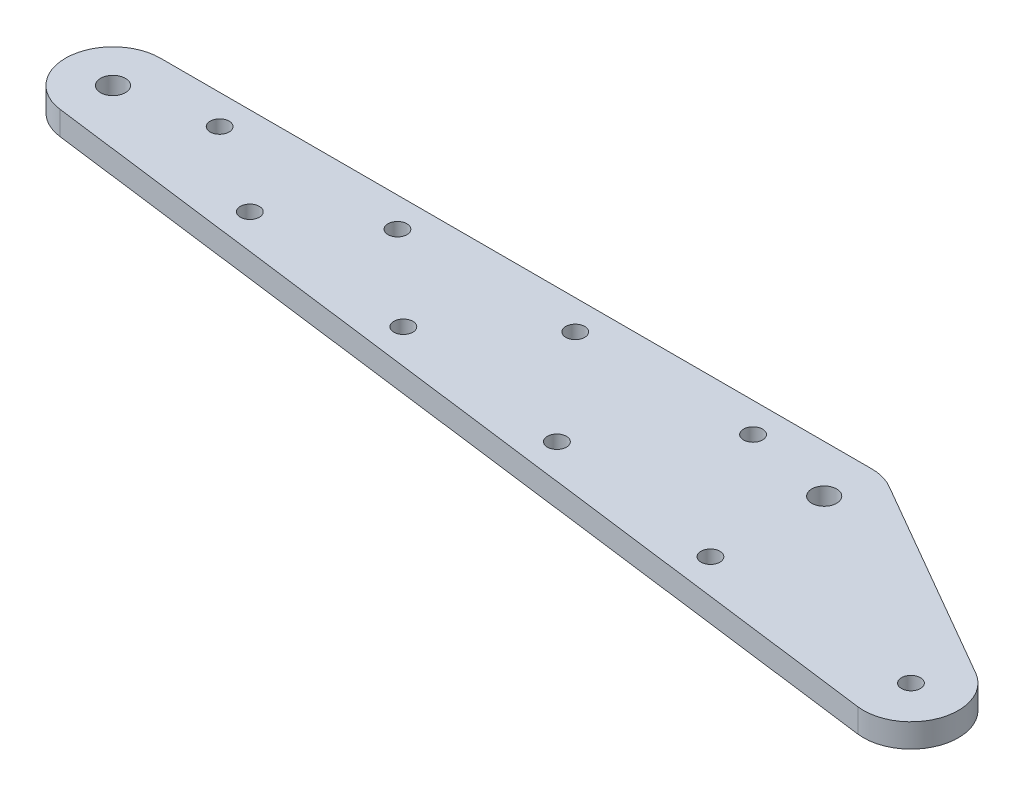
ISO-10303-21;
HEADER;
FILE_DESCRIPTION(('STEP AP214'),'2;1');
FILE_NAME('part.step','',(''),(''),'','','');
FILE_SCHEMA(('AUTOMOTIVE_DESIGN { 1 0 10303 214 1 1 1 1 }'));
ENDSEC;
DATA;
#1=APPLICATION_CONTEXT('core data for automotive mechanical design processes');
#2=APPLICATION_PROTOCOL_DEFINITION('international standard','automotive_design',2000,#1);
#3=PRODUCT_CONTEXT('',#1,'mechanical');
#4=PRODUCT('Part','Part','',(#3));
#5=PRODUCT_RELATED_PRODUCT_CATEGORY('part','',(#4));
#6=PRODUCT_DEFINITION_FORMATION('','',#4);
#7=PRODUCT_DEFINITION_CONTEXT('part definition',#1,'design');
#8=PRODUCT_DEFINITION('design','',#6,#7);
#9=PRODUCT_DEFINITION_SHAPE('','',#8);
#10=(LENGTH_UNIT() NAMED_UNIT(*) SI_UNIT(.MILLI.,.METRE.));
#11=(NAMED_UNIT(*) PLANE_ANGLE_UNIT() SI_UNIT($,.RADIAN.));
#12=(NAMED_UNIT(*) SI_UNIT($,.STERADIAN.) SOLID_ANGLE_UNIT());
#13=UNCERTAINTY_MEASURE_WITH_UNIT(LENGTH_MEASURE(1.E-05),#10,'distance_accuracy_value','');
#14=(GEOMETRIC_REPRESENTATION_CONTEXT(3) GLOBAL_UNCERTAINTY_ASSIGNED_CONTEXT((#13)) GLOBAL_UNIT_ASSIGNED_CONTEXT((#10,
#11,#12)) REPRESENTATION_CONTEXT('',''));
#15=CARTESIAN_POINT('',(0.,0.,0.));
#16=DIRECTION('',(0.,0.,1.));
#17=DIRECTION('',(1.,0.,0.));
#18=AXIS2_PLACEMENT_3D('',#15,#16,#17);
#19=CARTESIAN_POINT('',(0.,4.,0.));
#20=DIRECTION('',(0.,-1.,0.));
#21=DIRECTION('',(0.,0.,-1.));
#22=AXIS2_PLACEMENT_3D('',#19,#20,#21);
#23=PLANE('',#22);
#24=CARTESIAN_POINT('',(15.,4.,-3.));
#25=DIRECTION('',(0.,1.,0.));
#26=DIRECTION('',(0.,0.,1.));
#27=AXIS2_PLACEMENT_3D('',#24,#25,#26);
#28=CIRCLE('',#27,1.6);
#29=CARTESIAN_POINT('',(15.,4.,-1.4));
#30=VERTEX_POINT('',#29);
#31=EDGE_CURVE('E219',#30,#30,#28,.T.);
#32=ORIENTED_EDGE('',*,*,#31,.F.);
#33=EDGE_LOOP('',(#32));
#34=FACE_BOUND('',#33,.T.);
#35=CARTESIAN_POINT('',(30.,4.,6.90493983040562));
#36=DIRECTION('',(0.,1.,0.));
#37=DIRECTION('',(0.,0.,1.));
#38=AXIS2_PLACEMENT_3D('',#35,#36,#37);
#39=CIRCLE('',#38,1.6);
#40=CARTESIAN_POINT('',(30.,4.,8.50493983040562));
#41=VERTEX_POINT('',#40);
#42=EDGE_CURVE('E220',#41,#41,#39,.T.);
#43=ORIENTED_EDGE('',*,*,#42,.F.);
#44=EDGE_LOOP('',(#43));
#45=FACE_BOUND('',#44,.T.);
#46=CARTESIAN_POINT('',(45.,4.,-3.));
#47=DIRECTION('',(0.,1.,0.));
#48=DIRECTION('',(0.,0.,1.));
#49=AXIS2_PLACEMENT_3D('',#46,#47,#48);
#50=CIRCLE('',#49,1.6);
#51=CARTESIAN_POINT('',(45.,4.,-1.40000000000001));
#52=VERTEX_POINT('',#51);
#53=EDGE_CURVE('E230',#52,#52,#50,.T.);
#54=ORIENTED_EDGE('',*,*,#53,.F.);
#55=EDGE_LOOP('',(#54));
#56=FACE_BOUND('',#55,.T.);
#57=CARTESIAN_POINT('',(75.,4.,-3.));
#58=DIRECTION('',(0.,1.,0.));
#59=DIRECTION('',(0.,0.,1.));
#60=AXIS2_PLACEMENT_3D('',#57,#58,#59);
#61=CIRCLE('',#60,1.60000000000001);
#62=CARTESIAN_POINT('',(75.,4.,-1.4));
#63=VERTEX_POINT('',#62);
#64=EDGE_CURVE('E236',#63,#63,#61,.T.);
#65=ORIENTED_EDGE('',*,*,#64,.F.);
#66=EDGE_LOOP('',(#65));
#67=FACE_BOUND('',#66,.T.);
#68=CARTESIAN_POINT('',(105.,4.,-3.));
#69=DIRECTION('',(0.,1.,0.));
#70=DIRECTION('',(0.,0.,1.));
#71=AXIS2_PLACEMENT_3D('',#68,#69,#70);
#72=CIRCLE('',#71,1.60000000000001);
#73=CARTESIAN_POINT('',(105.,4.,-1.4));
#74=VERTEX_POINT('',#73);
#75=EDGE_CURVE('E242',#74,#74,#72,.T.);
#76=ORIENTED_EDGE('',*,*,#75,.F.);
#77=EDGE_LOOP('',(#76));
#78=FACE_BOUND('',#77,.T.);
#79=CARTESIAN_POINT('',(59.7522036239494,4.,10.7528456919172));
#80=DIRECTION('',(0.,1.,0.));
#81=DIRECTION('',(0.,0.,1.));
#82=AXIS2_PLACEMENT_3D('',#79,#80,#81);
#83=CIRCLE('',#82,1.6);
#84=CARTESIAN_POINT('',(59.7522036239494,4.,12.3528456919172));
#85=VERTEX_POINT('',#84);
#86=EDGE_CURVE('E248',#85,#85,#83,.T.);
#87=ORIENTED_EDGE('',*,*,#86,.F.);
#88=EDGE_LOOP('',(#87));
#89=FACE_BOUND('',#88,.T.);
#90=CARTESIAN_POINT('',(89.5044072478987,4.,14.6007515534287));
#91=DIRECTION('',(0.,1.,0.));
#92=DIRECTION('',(0.,0.,1.));
#93=AXIS2_PLACEMENT_3D('',#90,#91,#92);
#94=CIRCLE('',#93,1.6);
#95=CARTESIAN_POINT('',(89.5044072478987,4.,16.2007515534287));
#96=VERTEX_POINT('',#95);
#97=EDGE_CURVE('E254',#96,#96,#94,.T.);
#98=ORIENTED_EDGE('',*,*,#97,.F.);
#99=EDGE_LOOP('',(#98));
#100=FACE_BOUND('',#99,.T.);
#101=CARTESIAN_POINT('',(119.256610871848,4.,18.4486574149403));
#102=DIRECTION('',(0.,1.,0.));
#103=DIRECTION('',(0.,0.,1.));
#104=AXIS2_PLACEMENT_3D('',#101,#102,#103);
#105=CIRCLE('',#104,1.6);
#106=CARTESIAN_POINT('',(119.256610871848,4.,20.0486574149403));
#107=VERTEX_POINT('',#106);
#108=EDGE_CURVE('E260',#107,#107,#105,.T.);
#109=ORIENTED_EDGE('',*,*,#108,.F.);
#110=EDGE_LOOP('',(#109));
#111=FACE_BOUND('',#110,.T.);
#112=CARTESIAN_POINT('',(0.,4.,0.));
#113=DIRECTION('',(0.,1.,0.));
#114=DIRECTION('',(0.,0.,-1.));
#115=AXIS2_PLACEMENT_3D('',#112,#113,#114);
#116=CIRCLE('',#115,8.);
#117=CARTESIAN_POINT('',(0.,4.,-8.));
#118=VERTEX_POINT('',#117);
#119=CARTESIAN_POINT('',(-1.02610822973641,4.,7.93392096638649));
#120=VERTEX_POINT('',#119);
#121=EDGE_CURVE('E137',#118,#120,#116,.T.);
#122=ORIENTED_EDGE('',*,*,#121,.T.);
#123=DIRECTION('',(0.991740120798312,0.,0.128263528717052));
#124=VECTOR('',#123,1.);
#125=CARTESIAN_POINT('',(153.614907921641,4.,27.9339209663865));
#126=LINE('',#125,#124);
#127=CARTESIAN_POINT('',(153.614907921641,4.,27.9339209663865));
#128=VERTEX_POINT('',#127);
#129=EDGE_CURVE('E95',#120,#128,#126,.T.);
#130=ORIENTED_EDGE('',*,*,#129,.T.);
#131=CARTESIAN_POINT('',(154.641016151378,4.,20.));
#132=DIRECTION('',(0.,1.,0.));
#133=DIRECTION('',(0.,0.,-1.));
#134=AXIS2_PLACEMENT_3D('',#131,#132,#133);
#135=CIRCLE('',#134,7.99999999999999);
#136=CARTESIAN_POINT('',(158.641016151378,4.,13.0717967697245));
#137=VERTEX_POINT('',#136);
#138=EDGE_CURVE('E108',#128,#137,#135,.T.);
#139=ORIENTED_EDGE('',*,*,#138,.T.);
#140=DIRECTION('',(-0.866025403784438,0.,-0.500000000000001));
#141=VECTOR('',#140,1.);
#142=CARTESIAN_POINT('',(124.,4.,-6.92820323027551));
#143=LINE('',#142,#141);
#144=CARTESIAN_POINT('',(124.,4.,-6.92820323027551));
#145=VERTEX_POINT('',#144);
#146=EDGE_CURVE('E102',#137,#145,#143,.T.);
#147=ORIENTED_EDGE('',*,*,#146,.T.);
#148=CARTESIAN_POINT('',(120.,4.,0.));
#149=DIRECTION('',(0.,1.,0.));
#150=DIRECTION('',(0.,0.,-1.));
#151=AXIS2_PLACEMENT_3D('',#148,#149,#150);
#152=CIRCLE('',#151,8.);
#153=CARTESIAN_POINT('',(120.,4.,-8.));
#154=VERTEX_POINT('',#153);
#155=EDGE_CURVE('E106',#145,#154,#152,.T.);
#156=ORIENTED_EDGE('',*,*,#155,.T.);
#157=DIRECTION('',(-1.,0.,0.));
#158=VECTOR('',#157,1.);
#159=CARTESIAN_POINT('',(0.,4.,-8.));
#160=LINE('',#159,#158);
#161=EDGE_CURVE('E58',#154,#118,#160,.T.);
#162=ORIENTED_EDGE('',*,*,#161,.T.);
#163=EDGE_LOOP('',(#122,#130,#139,#147,#156,#162));
#164=FACE_BOUND('',#163,.T.);
#165=CARTESIAN_POINT('',(0.,4.,0.));
#166=DIRECTION('',(0.,1.,0.));
#167=DIRECTION('',(0.,0.,1.));
#168=AXIS2_PLACEMENT_3D('',#165,#166,#167);
#169=CIRCLE('',#168,2.1);
#170=CARTESIAN_POINT('',(0.,4.,2.1));
#171=VERTEX_POINT('',#170);
#172=EDGE_CURVE('E130',#171,#171,#169,.T.);
#173=ORIENTED_EDGE('',*,*,#172,.F.);
#174=EDGE_LOOP('',(#173));
#175=FACE_BOUND('',#174,.T.);
#176=CARTESIAN_POINT('',(154.641016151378,4.,20.));
#177=DIRECTION('',(0.,1.,0.));
#178=DIRECTION('',(0.,0.,1.));
#179=AXIS2_PLACEMENT_3D('',#176,#177,#178);
#180=CIRCLE('',#179,1.59999999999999);
#181=CARTESIAN_POINT('',(154.641016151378,4.,21.6));
#182=VERTEX_POINT('',#181);
#183=EDGE_CURVE('E272',#182,#182,#180,.T.);
#184=ORIENTED_EDGE('',*,*,#183,.F.);
#185=EDGE_LOOP('',(#184));
#186=FACE_BOUND('',#185,.T.);
#187=CARTESIAN_POINT('',(120.,4.,0.));
#188=DIRECTION('',(0.,1.,0.));
#189=DIRECTION('',(0.,0.,1.));
#190=AXIS2_PLACEMENT_3D('',#187,#188,#189);
#191=CIRCLE('',#190,2.09999999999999);
#192=CARTESIAN_POINT('',(120.,4.,2.09999999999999));
#193=VERTEX_POINT('',#192);
#194=EDGE_CURVE('E266',#193,#193,#191,.T.);
#195=ORIENTED_EDGE('',*,*,#194,.F.);
#196=EDGE_LOOP('',(#195));
#197=FACE_BOUND('',#196,.T.);
#198=ADVANCED_FACE('F41',(#34,#45,#56,#67,#78,#89,#100,#111,#164,#175,#186,#197),#23,.F.);
#199=CARTESIAN_POINT('',(0.,0.,0.));
#200=DIRECTION('',(0.,-1.,0.));
#201=DIRECTION('',(0.,0.,-1.));
#202=AXIS2_PLACEMENT_3D('',#199,#200,#201);
#203=PLANE('',#202);
#204=CARTESIAN_POINT('',(15.,0.,-3.));
#205=DIRECTION('',(0.,1.,0.));
#206=DIRECTION('',(0.,0.,1.));
#207=AXIS2_PLACEMENT_3D('',#204,#205,#206);
#208=CIRCLE('',#207,1.6);
#209=CARTESIAN_POINT('',(15.,0.,-1.4));
#210=VERTEX_POINT('',#209);
#211=EDGE_CURVE('E217',#210,#210,#208,.T.);
#212=ORIENTED_EDGE('',*,*,#211,.T.);
#213=EDGE_LOOP('',(#212));
#214=FACE_BOUND('',#213,.T.);
#215=CARTESIAN_POINT('',(30.,0.,6.90493983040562));
#216=DIRECTION('',(0.,1.,0.));
#217=DIRECTION('',(0.,0.,1.));
#218=AXIS2_PLACEMENT_3D('',#215,#216,#217);
#219=CIRCLE('',#218,1.6);
#220=CARTESIAN_POINT('',(30.,0.,8.50493983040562));
#221=VERTEX_POINT('',#220);
#222=EDGE_CURVE('E225',#221,#221,#219,.T.);
#223=ORIENTED_EDGE('',*,*,#222,.T.);
#224=EDGE_LOOP('',(#223));
#225=FACE_BOUND('',#224,.T.);
#226=CARTESIAN_POINT('',(45.,0.,-3.));
#227=DIRECTION('',(0.,1.,0.));
#228=DIRECTION('',(0.,0.,1.));
#229=AXIS2_PLACEMENT_3D('',#226,#227,#228);
#230=CIRCLE('',#229,1.6);
#231=CARTESIAN_POINT('',(45.,0.,-1.40000000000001));
#232=VERTEX_POINT('',#231);
#233=EDGE_CURVE('E233',#232,#232,#230,.T.);
#234=ORIENTED_EDGE('',*,*,#233,.T.);
#235=EDGE_LOOP('',(#234));
#236=FACE_BOUND('',#235,.T.);
#237=CARTESIAN_POINT('',(75.,0.,-3.));
#238=DIRECTION('',(0.,1.,0.));
#239=DIRECTION('',(0.,0.,1.));
#240=AXIS2_PLACEMENT_3D('',#237,#238,#239);
#241=CIRCLE('',#240,1.60000000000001);
#242=CARTESIAN_POINT('',(75.,0.,-1.4));
#243=VERTEX_POINT('',#242);
#244=EDGE_CURVE('E239',#243,#243,#241,.T.);
#245=ORIENTED_EDGE('',*,*,#244,.T.);
#246=EDGE_LOOP('',(#245));
#247=FACE_BOUND('',#246,.T.);
#248=CARTESIAN_POINT('',(105.,0.,-3.));
#249=DIRECTION('',(0.,1.,0.));
#250=DIRECTION('',(0.,0.,1.));
#251=AXIS2_PLACEMENT_3D('',#248,#249,#250);
#252=CIRCLE('',#251,1.60000000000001);
#253=CARTESIAN_POINT('',(105.,0.,-1.4));
#254=VERTEX_POINT('',#253);
#255=EDGE_CURVE('E245',#254,#254,#252,.T.);
#256=ORIENTED_EDGE('',*,*,#255,.T.);
#257=EDGE_LOOP('',(#256));
#258=FACE_BOUND('',#257,.T.);
#259=CARTESIAN_POINT('',(59.7522036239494,0.,10.7528456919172));
#260=DIRECTION('',(0.,1.,0.));
#261=DIRECTION('',(0.,0.,1.));
#262=AXIS2_PLACEMENT_3D('',#259,#260,#261);
#263=CIRCLE('',#262,1.6);
#264=CARTESIAN_POINT('',(59.7522036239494,0.,12.3528456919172));
#265=VERTEX_POINT('',#264);
#266=EDGE_CURVE('E251',#265,#265,#263,.T.);
#267=ORIENTED_EDGE('',*,*,#266,.T.);
#268=EDGE_LOOP('',(#267));
#269=FACE_BOUND('',#268,.T.);
#270=CARTESIAN_POINT('',(89.5044072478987,0.,14.6007515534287));
#271=DIRECTION('',(0.,1.,0.));
#272=DIRECTION('',(0.,0.,1.));
#273=AXIS2_PLACEMENT_3D('',#270,#271,#272);
#274=CIRCLE('',#273,1.6);
#275=CARTESIAN_POINT('',(89.5044072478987,0.,16.2007515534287));
#276=VERTEX_POINT('',#275);
#277=EDGE_CURVE('E257',#276,#276,#274,.T.);
#278=ORIENTED_EDGE('',*,*,#277,.T.);
#279=EDGE_LOOP('',(#278));
#280=FACE_BOUND('',#279,.T.);
#281=CARTESIAN_POINT('',(119.256610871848,0.,18.4486574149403));
#282=DIRECTION('',(0.,1.,0.));
#283=DIRECTION('',(0.,0.,1.));
#284=AXIS2_PLACEMENT_3D('',#281,#282,#283);
#285=CIRCLE('',#284,1.6);
#286=CARTESIAN_POINT('',(119.256610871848,0.,20.0486574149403));
#287=VERTEX_POINT('',#286);
#288=EDGE_CURVE('E263',#287,#287,#285,.T.);
#289=ORIENTED_EDGE('',*,*,#288,.T.);
#290=EDGE_LOOP('',(#289));
#291=FACE_BOUND('',#290,.T.);
#292=CARTESIAN_POINT('',(154.641016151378,0.,20.));
#293=DIRECTION('',(0.,1.,0.));
#294=DIRECTION('',(0.,0.,1.));
#295=AXIS2_PLACEMENT_3D('',#292,#293,#294);
#296=CIRCLE('',#295,1.59999999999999);
#297=CARTESIAN_POINT('',(154.641016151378,0.,21.6));
#298=VERTEX_POINT('',#297);
#299=EDGE_CURVE('E269',#298,#298,#296,.T.);
#300=ORIENTED_EDGE('',*,*,#299,.T.);
#301=EDGE_LOOP('',(#300));
#302=FACE_BOUND('',#301,.T.);
#303=CARTESIAN_POINT('',(0.,0.,0.));
#304=DIRECTION('',(0.,1.,0.));
#305=DIRECTION('',(0.,0.,-1.));
#306=AXIS2_PLACEMENT_3D('',#303,#304,#305);
#307=CIRCLE('',#306,8.);
#308=CARTESIAN_POINT('',(0.,0.,-8.));
#309=VERTEX_POINT('',#308);
#310=CARTESIAN_POINT('',(-1.02610822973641,0.,7.93392096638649));
#311=VERTEX_POINT('',#310);
#312=EDGE_CURVE('E126',#309,#311,#307,.T.);
#313=ORIENTED_EDGE('',*,*,#312,.F.);
#314=DIRECTION('',(-1.,0.,0.));
#315=VECTOR('',#314,1.);
#316=CARTESIAN_POINT('',(0.,0.,-8.));
#317=LINE('',#316,#315);
#318=CARTESIAN_POINT('',(120.,0.,-8.));
#319=VERTEX_POINT('',#318);
#320=EDGE_CURVE('E87',#319,#309,#317,.T.);
#321=ORIENTED_EDGE('',*,*,#320,.F.);
#322=CARTESIAN_POINT('',(120.,0.,0.));
#323=DIRECTION('',(0.,1.,0.));
#324=DIRECTION('',(0.,0.,-1.));
#325=AXIS2_PLACEMENT_3D('',#322,#323,#324);
#326=CIRCLE('',#325,8.);
#327=CARTESIAN_POINT('',(124.,0.,-6.92820323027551));
#328=VERTEX_POINT('',#327);
#329=EDGE_CURVE('E81',#328,#319,#326,.T.);
#330=ORIENTED_EDGE('',*,*,#329,.F.);
#331=DIRECTION('',(-0.866025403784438,0.,-0.500000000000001));
#332=VECTOR('',#331,1.);
#333=CARTESIAN_POINT('',(124.,0.,-6.92820323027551));
#334=LINE('',#333,#332);
#335=CARTESIAN_POINT('',(158.641016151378,0.,13.0717967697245));
#336=VERTEX_POINT('',#335);
#337=EDGE_CURVE('E116',#336,#328,#334,.T.);
#338=ORIENTED_EDGE('',*,*,#337,.F.);
#339=CARTESIAN_POINT('',(154.641016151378,0.,20.));
#340=DIRECTION('',(0.,1.,0.));
#341=DIRECTION('',(0.,0.,-1.));
#342=AXIS2_PLACEMENT_3D('',#339,#340,#341);
#343=CIRCLE('',#342,7.99999999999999);
#344=CARTESIAN_POINT('',(153.614907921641,0.,27.9339209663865));
#345=VERTEX_POINT('',#344);
#346=EDGE_CURVE('E132',#345,#336,#343,.T.);
#347=ORIENTED_EDGE('',*,*,#346,.F.);
#348=DIRECTION('',(0.991740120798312,0.,0.128263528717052));
#349=VECTOR('',#348,1.);
#350=CARTESIAN_POINT('',(153.614907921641,0.,27.9339209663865));
#351=LINE('',#350,#349);
#352=EDGE_CURVE('E129',#311,#345,#351,.T.);
#353=ORIENTED_EDGE('',*,*,#352,.F.);
#354=EDGE_LOOP('',(#313,#321,#330,#338,#347,#353));
#355=FACE_BOUND('',#354,.T.);
#356=CARTESIAN_POINT('',(0.,0.,0.));
#357=DIRECTION('',(0.,1.,0.));
#358=DIRECTION('',(0.,0.,1.));
#359=AXIS2_PLACEMENT_3D('',#356,#357,#358);
#360=CIRCLE('',#359,2.1);
#361=CARTESIAN_POINT('',(0.,0.,2.1));
#362=VERTEX_POINT('',#361);
#363=EDGE_CURVE('E275',#362,#362,#360,.T.);
#364=ORIENTED_EDGE('',*,*,#363,.T.);
#365=EDGE_LOOP('',(#364));
#366=FACE_BOUND('',#365,.T.);
#367=CARTESIAN_POINT('',(120.,0.,0.));
#368=DIRECTION('',(0.,1.,0.));
#369=DIRECTION('',(0.,0.,1.));
#370=AXIS2_PLACEMENT_3D('',#367,#368,#369);
#371=CIRCLE('',#370,2.09999999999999);
#372=CARTESIAN_POINT('',(120.,0.,2.09999999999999));
#373=VERTEX_POINT('',#372);
#374=EDGE_CURVE('E222',#373,#373,#371,.T.);
#375=ORIENTED_EDGE('',*,*,#374,.T.);
#376=EDGE_LOOP('',(#375));
#377=FACE_BOUND('',#376,.T.);
#378=ADVANCED_FACE('F146',(#214,#225,#236,#247,#258,#269,#280,#291,#302,#355,#366,#377),#203,.T.);
#379=CARTESIAN_POINT('',(0.,4.,0.));
#380=DIRECTION('',(0.,-1.,0.));
#381=DIRECTION('',(0.,0.,-1.));
#382=AXIS2_PLACEMENT_3D('',#379,#380,#381);
#383=CYLINDRICAL_SURFACE('',#382,8.);
#384=ORIENTED_EDGE('',*,*,#312,.T.);
#385=DIRECTION('',(0.,-1.,0.));
#386=VECTOR('',#385,1.);
#387=CARTESIAN_POINT('',(-1.02610822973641,4.,7.93392096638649));
#388=LINE('',#387,#386);
#389=EDGE_CURVE('E11',#120,#311,#388,.T.);
#390=ORIENTED_EDGE('',*,*,#389,.F.);
#391=ORIENTED_EDGE('',*,*,#121,.F.);
#392=DIRECTION('',(0.,-1.,0.));
#393=VECTOR('',#392,1.);
#394=CARTESIAN_POINT('',(0.,4.,-8.));
#395=LINE('',#394,#393);
#396=EDGE_CURVE('E122',#118,#309,#395,.T.);
#397=ORIENTED_EDGE('',*,*,#396,.T.);
#398=EDGE_LOOP('',(#384,#390,#391,#397));
#399=FACE_BOUND('',#398,.T.);
#400=ADVANCED_FACE('F43',(#399),#383,.T.);
#401=CARTESIAN_POINT('',(153.614907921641,4.,27.9339209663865));
#402=DIRECTION('',(0.128263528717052,0.,-0.991740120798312));
#403=DIRECTION('',(-0.991740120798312,0.,-0.128263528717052));
#404=AXIS2_PLACEMENT_3D('',#401,#402,#403);
#405=PLANE('',#404);
#406=ORIENTED_EDGE('',*,*,#352,.T.);
#407=DIRECTION('',(0.,-1.,0.));
#408=VECTOR('',#407,1.);
#409=CARTESIAN_POINT('',(153.614907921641,4.,27.9339209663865));
#410=LINE('',#409,#408);
#411=EDGE_CURVE('E50',#128,#345,#410,.T.);
#412=ORIENTED_EDGE('',*,*,#411,.F.);
#413=ORIENTED_EDGE('',*,*,#129,.F.);
#414=ORIENTED_EDGE('',*,*,#389,.T.);
#415=EDGE_LOOP('',(#406,#412,#413,#414));
#416=FACE_BOUND('',#415,.T.);
#417=ADVANCED_FACE('F384',(#416),#405,.F.);
#418=CARTESIAN_POINT('',(154.641016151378,4.,20.));
#419=DIRECTION('',(0.,-1.,0.));
#420=DIRECTION('',(0.,0.,-1.));
#421=AXIS2_PLACEMENT_3D('',#418,#419,#420);
#422=CYLINDRICAL_SURFACE('',#421,7.99999999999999);
#423=ORIENTED_EDGE('',*,*,#346,.T.);
#424=DIRECTION('',(0.,-1.,0.));
#425=VECTOR('',#424,1.);
#426=CARTESIAN_POINT('',(158.641016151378,4.,13.0717967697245));
#427=LINE('',#426,#425);
#428=EDGE_CURVE('E117',#137,#336,#427,.T.);
#429=ORIENTED_EDGE('',*,*,#428,.F.);
#430=ORIENTED_EDGE('',*,*,#138,.F.);
#431=ORIENTED_EDGE('',*,*,#411,.T.);
#432=EDGE_LOOP('',(#423,#429,#430,#431));
#433=FACE_BOUND('',#432,.T.);
#434=ADVANCED_FACE('F143',(#433),#422,.T.);
#435=CARTESIAN_POINT('',(124.,4.,-6.92820323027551));
#436=DIRECTION('',(-0.500000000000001,0.,0.866025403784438));
#437=DIRECTION('',(0.866025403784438,0.,0.500000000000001));
#438=AXIS2_PLACEMENT_3D('',#435,#436,#437);
#439=PLANE('',#438);
#440=ORIENTED_EDGE('',*,*,#337,.T.);
#441=DIRECTION('',(0.,-1.,0.));
#442=VECTOR('',#441,1.);
#443=CARTESIAN_POINT('',(124.,4.,-6.92820323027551));
#444=LINE('',#443,#442);
#445=EDGE_CURVE('E113',#145,#328,#444,.T.);
#446=ORIENTED_EDGE('',*,*,#445,.F.);
#447=ORIENTED_EDGE('',*,*,#146,.F.);
#448=ORIENTED_EDGE('',*,*,#428,.T.);
#449=EDGE_LOOP('',(#440,#446,#447,#448));
#450=FACE_BOUND('',#449,.T.);
#451=ADVANCED_FACE('F114',(#450),#439,.F.);
#452=CARTESIAN_POINT('',(120.,4.,0.));
#453=DIRECTION('',(0.,-1.,0.));
#454=DIRECTION('',(0.,0.,-1.));
#455=AXIS2_PLACEMENT_3D('',#452,#453,#454);
#456=CYLINDRICAL_SURFACE('',#455,8.);
#457=ORIENTED_EDGE('',*,*,#329,.T.);
#458=DIRECTION('',(0.,-1.,0.));
#459=VECTOR('',#458,1.);
#460=CARTESIAN_POINT('',(120.,4.,-8.));
#461=LINE('',#460,#459);
#462=EDGE_CURVE('E118',#154,#319,#461,.T.);
#463=ORIENTED_EDGE('',*,*,#462,.F.);
#464=ORIENTED_EDGE('',*,*,#155,.F.);
#465=ORIENTED_EDGE('',*,*,#445,.T.);
#466=EDGE_LOOP('',(#457,#463,#464,#465));
#467=FACE_BOUND('',#466,.T.);
#468=ADVANCED_FACE('F120',(#467),#456,.T.);
#469=CARTESIAN_POINT('',(0.,4.,-8.));
#470=DIRECTION('',(0.,0.,1.));
#471=DIRECTION('',(1.,0.,0.));
#472=AXIS2_PLACEMENT_3D('',#469,#470,#471);
#473=PLANE('',#472);
#474=ORIENTED_EDGE('',*,*,#320,.T.);
#475=ORIENTED_EDGE('',*,*,#396,.F.);
#476=ORIENTED_EDGE('',*,*,#161,.F.);
#477=ORIENTED_EDGE('',*,*,#462,.T.);
#478=EDGE_LOOP('',(#474,#475,#476,#477));
#479=FACE_BOUND('',#478,.T.);
#480=ADVANCED_FACE('F151',(#479),#473,.F.);
#481=CARTESIAN_POINT('',(0.,4.,0.));
#482=DIRECTION('',(0.,-1.,0.));
#483=DIRECTION('',(0.,0.,-1.));
#484=AXIS2_PLACEMENT_3D('',#481,#482,#483);
#485=CYLINDRICAL_SURFACE('',#484,2.1);
#486=ORIENTED_EDGE('',*,*,#172,.T.);
#487=EDGE_LOOP('',(#486));
#488=FACE_BOUND('',#487,.T.);
#489=ORIENTED_EDGE('',*,*,#363,.F.);
#490=EDGE_LOOP('',(#489));
#491=FACE_BOUND('',#490,.T.);
#492=ADVANCED_FACE('F153',(#488,#491),#485,.F.);
#493=CARTESIAN_POINT('',(154.641016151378,4.,20.));
#494=DIRECTION('',(0.,-1.,0.));
#495=DIRECTION('',(0.,0.,-1.));
#496=AXIS2_PLACEMENT_3D('',#493,#494,#495);
#497=CYLINDRICAL_SURFACE('',#496,1.59999999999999);
#498=ORIENTED_EDGE('',*,*,#183,.T.);
#499=EDGE_LOOP('',(#498));
#500=FACE_BOUND('',#499,.T.);
#501=ORIENTED_EDGE('',*,*,#299,.F.);
#502=EDGE_LOOP('',(#501));
#503=FACE_BOUND('',#502,.T.);
#504=ADVANCED_FACE('F159',(#500,#503),#497,.F.);
#505=CARTESIAN_POINT('',(120.,4.,0.));
#506=DIRECTION('',(0.,-1.,0.));
#507=DIRECTION('',(0.,0.,-1.));
#508=AXIS2_PLACEMENT_3D('',#505,#506,#507);
#509=CYLINDRICAL_SURFACE('',#508,2.09999999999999);
#510=ORIENTED_EDGE('',*,*,#194,.T.);
#511=EDGE_LOOP('',(#510));
#512=FACE_BOUND('',#511,.T.);
#513=ORIENTED_EDGE('',*,*,#374,.F.);
#514=EDGE_LOOP('',(#513));
#515=FACE_BOUND('',#514,.T.);
#516=ADVANCED_FACE('F177',(#512,#515),#509,.F.);
#517=CARTESIAN_POINT('',(119.256610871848,0.,18.4486574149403));
#518=DIRECTION('',(0.,1.,0.));
#519=DIRECTION('',(0.,0.,1.));
#520=AXIS2_PLACEMENT_3D('',#517,#518,#519);
#521=CYLINDRICAL_SURFACE('',#520,1.6);
#522=ORIENTED_EDGE('',*,*,#288,.F.);
#523=EDGE_LOOP('',(#522));
#524=FACE_BOUND('',#523,.T.);
#525=ORIENTED_EDGE('',*,*,#108,.T.);
#526=EDGE_LOOP('',(#525));
#527=FACE_BOUND('',#526,.T.);
#528=ADVANCED_FACE('F180',(#524,#527),#521,.F.);
#529=CARTESIAN_POINT('',(89.5044072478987,0.,14.6007515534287));
#530=DIRECTION('',(0.,1.,0.));
#531=DIRECTION('',(0.,0.,1.));
#532=AXIS2_PLACEMENT_3D('',#529,#530,#531);
#533=CYLINDRICAL_SURFACE('',#532,1.6);
#534=ORIENTED_EDGE('',*,*,#277,.F.);
#535=EDGE_LOOP('',(#534));
#536=FACE_BOUND('',#535,.T.);
#537=ORIENTED_EDGE('',*,*,#97,.T.);
#538=EDGE_LOOP('',(#537));
#539=FACE_BOUND('',#538,.T.);
#540=ADVANCED_FACE('F184',(#536,#539),#533,.F.);
#541=CARTESIAN_POINT('',(59.7522036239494,0.,10.7528456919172));
#542=DIRECTION('',(0.,1.,0.));
#543=DIRECTION('',(0.,0.,1.));
#544=AXIS2_PLACEMENT_3D('',#541,#542,#543);
#545=CYLINDRICAL_SURFACE('',#544,1.6);
#546=ORIENTED_EDGE('',*,*,#266,.F.);
#547=EDGE_LOOP('',(#546));
#548=FACE_BOUND('',#547,.T.);
#549=ORIENTED_EDGE('',*,*,#86,.T.);
#550=EDGE_LOOP('',(#549));
#551=FACE_BOUND('',#550,.T.);
#552=ADVANCED_FACE('F188',(#548,#551),#545,.F.);
#553=CARTESIAN_POINT('',(105.,0.,-3.));
#554=DIRECTION('',(0.,1.,0.));
#555=DIRECTION('',(0.,0.,1.));
#556=AXIS2_PLACEMENT_3D('',#553,#554,#555);
#557=CYLINDRICAL_SURFACE('',#556,1.60000000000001);
#558=ORIENTED_EDGE('',*,*,#255,.F.);
#559=EDGE_LOOP('',(#558));
#560=FACE_BOUND('',#559,.T.);
#561=ORIENTED_EDGE('',*,*,#75,.T.);
#562=EDGE_LOOP('',(#561));
#563=FACE_BOUND('',#562,.T.);
#564=ADVANCED_FACE('F192',(#560,#563),#557,.F.);
#565=CARTESIAN_POINT('',(75.,0.,-3.));
#566=DIRECTION('',(0.,1.,0.));
#567=DIRECTION('',(0.,0.,1.));
#568=AXIS2_PLACEMENT_3D('',#565,#566,#567);
#569=CYLINDRICAL_SURFACE('',#568,1.60000000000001);
#570=ORIENTED_EDGE('',*,*,#244,.F.);
#571=EDGE_LOOP('',(#570));
#572=FACE_BOUND('',#571,.T.);
#573=ORIENTED_EDGE('',*,*,#64,.T.);
#574=EDGE_LOOP('',(#573));
#575=FACE_BOUND('',#574,.T.);
#576=ADVANCED_FACE('F196',(#572,#575),#569,.F.);
#577=CARTESIAN_POINT('',(45.,0.,-3.));
#578=DIRECTION('',(0.,1.,0.));
#579=DIRECTION('',(0.,0.,1.));
#580=AXIS2_PLACEMENT_3D('',#577,#578,#579);
#581=CYLINDRICAL_SURFACE('',#580,1.6);
#582=ORIENTED_EDGE('',*,*,#233,.F.);
#583=EDGE_LOOP('',(#582));
#584=FACE_BOUND('',#583,.T.);
#585=ORIENTED_EDGE('',*,*,#53,.T.);
#586=EDGE_LOOP('',(#585));
#587=FACE_BOUND('',#586,.T.);
#588=ADVANCED_FACE('F200',(#584,#587),#581,.F.);
#589=CARTESIAN_POINT('',(30.,0.,6.90493983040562));
#590=DIRECTION('',(0.,1.,0.));
#591=DIRECTION('',(0.,0.,1.));
#592=AXIS2_PLACEMENT_3D('',#589,#590,#591);
#593=CYLINDRICAL_SURFACE('',#592,1.6);
#594=ORIENTED_EDGE('',*,*,#222,.F.);
#595=EDGE_LOOP('',(#594));
#596=FACE_BOUND('',#595,.T.);
#597=ORIENTED_EDGE('',*,*,#42,.T.);
#598=EDGE_LOOP('',(#597));
#599=FACE_BOUND('',#598,.T.);
#600=ADVANCED_FACE('F204',(#596,#599),#593,.F.);
#601=CARTESIAN_POINT('',(15.,0.,-3.));
#602=DIRECTION('',(0.,1.,0.));
#603=DIRECTION('',(0.,0.,1.));
#604=AXIS2_PLACEMENT_3D('',#601,#602,#603);
#605=CYLINDRICAL_SURFACE('',#604,1.6);
#606=ORIENTED_EDGE('',*,*,#211,.F.);
#607=EDGE_LOOP('',(#606));
#608=FACE_BOUND('',#607,.T.);
#609=ORIENTED_EDGE('',*,*,#31,.T.);
#610=EDGE_LOOP('',(#609));
#611=FACE_BOUND('',#610,.T.);
#612=ADVANCED_FACE('F208',(#608,#611),#605,.F.);
#613=CLOSED_SHELL('',(#198,#378,#400,#417,#434,#451,#468,#480,#492,#504,#516,#528,#540,#552,
#564,#576,#588,#600,#612));
#614=MANIFOLD_SOLID_BREP('B2',#613);
#615=ADVANCED_BREP_SHAPE_REPRESENTATION('',(#18,#614),#14);
#616=SHAPE_DEFINITION_REPRESENTATION(#9,#615);
ENDSEC;
END-ISO-10303-21;
